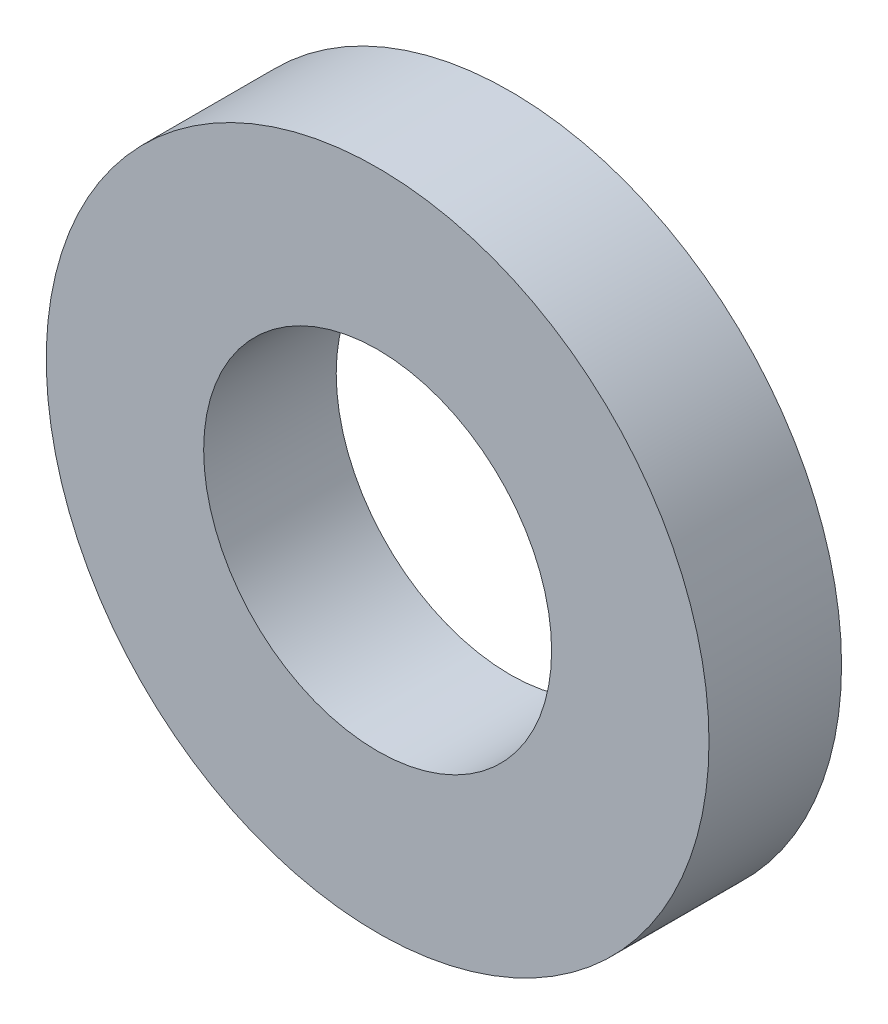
ISO-10303-21;
HEADER;
FILE_DESCRIPTION(('STEP AP214'),'2;1');
FILE_NAME('part.step','',(''),(''),'','','');
FILE_SCHEMA(('AUTOMOTIVE_DESIGN { 1 0 10303 214 1 1 1 1 }'));
ENDSEC;
DATA;
#1=APPLICATION_CONTEXT('core data for automotive mechanical design processes');
#2=APPLICATION_PROTOCOL_DEFINITION('international standard','automotive_design',2000,#1);
#3=PRODUCT_CONTEXT('',#1,'mechanical');
#4=PRODUCT('Part','Part','',(#3));
#5=PRODUCT_RELATED_PRODUCT_CATEGORY('part','',(#4));
#6=PRODUCT_DEFINITION_FORMATION('','',#4);
#7=PRODUCT_DEFINITION_CONTEXT('part definition',#1,'design');
#8=PRODUCT_DEFINITION('design','',#6,#7);
#9=PRODUCT_DEFINITION_SHAPE('','',#8);
#10=(LENGTH_UNIT() NAMED_UNIT(*) SI_UNIT(.MILLI.,.METRE.));
#11=(NAMED_UNIT(*) PLANE_ANGLE_UNIT() SI_UNIT($,.RADIAN.));
#12=(NAMED_UNIT(*) SI_UNIT($,.STERADIAN.) SOLID_ANGLE_UNIT());
#13=UNCERTAINTY_MEASURE_WITH_UNIT(LENGTH_MEASURE(1.E-05),#10,'distance_accuracy_value','');
#14=(GEOMETRIC_REPRESENTATION_CONTEXT(3) GLOBAL_UNCERTAINTY_ASSIGNED_CONTEXT((#13)) GLOBAL_UNIT_ASSIGNED_CONTEXT((#10,
#11,#12)) REPRESENTATION_CONTEXT('',''));
#15=CARTESIAN_POINT('',(0.,0.,0.));
#16=DIRECTION('',(0.,0.,1.));
#17=DIRECTION('',(1.,0.,0.));
#18=AXIS2_PLACEMENT_3D('',#15,#16,#17);
#19=CARTESIAN_POINT('',(350.941170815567,1.11022302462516E-13,16.));
#20=DIRECTION('',(0.,0.,1.));
#21=DIRECTION('',(1.,0.,0.));
#22=AXIS2_PLACEMENT_3D('',#19,#20,#21);
#23=PLANE('',#22);
#24=CARTESIAN_POINT('',(350.941170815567,1.11022302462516E-13,16.));
#25=DIRECTION('',(0.,0.,1.));
#26=DIRECTION('',(1.,0.,0.));
#27=AXIS2_PLACEMENT_3D('',#24,#25,#26);
#28=CIRCLE('',#27,40.);
#29=CARTESIAN_POINT('',(390.941170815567,1.11022302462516E-13,16.));
#30=VERTEX_POINT('',#29);
#31=EDGE_CURVE('E12',#30,#30,#28,.T.);
#32=ORIENTED_EDGE('',*,*,#31,.T.);
#33=EDGE_LOOP('',(#32));
#34=FACE_BOUND('',#33,.T.);
#35=CARTESIAN_POINT('',(350.941170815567,1.11022302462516E-13,16.));
#36=DIRECTION('',(0.,0.,1.));
#37=DIRECTION('',(1.,0.,0.));
#38=AXIS2_PLACEMENT_3D('',#35,#36,#37);
#39=CIRCLE('',#38,21.);
#40=CARTESIAN_POINT('',(371.941170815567,1.11022302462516E-13,16.));
#41=VERTEX_POINT('',#40);
#42=EDGE_CURVE('E51',#41,#41,#39,.T.);
#43=ORIENTED_EDGE('',*,*,#42,.F.);
#44=EDGE_LOOP('',(#43));
#45=FACE_BOUND('',#44,.T.);
#46=ADVANCED_FACE('F40',(#34,#45),#23,.T.);
#47=CARTESIAN_POINT('',(350.941170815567,1.11022302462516E-13,0.));
#48=DIRECTION('',(0.,0.,1.));
#49=DIRECTION('',(1.,0.,0.));
#50=AXIS2_PLACEMENT_3D('',#47,#48,#49);
#51=PLANE('',#50);
#52=CARTESIAN_POINT('',(350.941170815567,1.11022302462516E-13,0.));
#53=DIRECTION('',(0.,0.,1.));
#54=DIRECTION('',(1.,0.,0.));
#55=AXIS2_PLACEMENT_3D('',#52,#53,#54);
#56=CIRCLE('',#55,40.);
#57=CARTESIAN_POINT('',(390.941170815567,1.11022302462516E-13,0.));
#58=VERTEX_POINT('',#57);
#59=EDGE_CURVE('E44',#58,#58,#56,.T.);
#60=ORIENTED_EDGE('',*,*,#59,.F.);
#61=EDGE_LOOP('',(#60));
#62=FACE_BOUND('',#61,.T.);
#63=CARTESIAN_POINT('',(350.941170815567,1.11022302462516E-13,0.));
#64=DIRECTION('',(0.,0.,1.));
#65=DIRECTION('',(1.,0.,0.));
#66=AXIS2_PLACEMENT_3D('',#63,#64,#65);
#67=CIRCLE('',#66,21.);
#68=CARTESIAN_POINT('',(371.941170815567,1.11022302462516E-13,0.));
#69=VERTEX_POINT('',#68);
#70=EDGE_CURVE('E53',#69,#69,#67,.T.);
#71=ORIENTED_EDGE('',*,*,#70,.T.);
#72=EDGE_LOOP('',(#71));
#73=FACE_BOUND('',#72,.T.);
#74=ADVANCED_FACE('F63',(#62,#73),#51,.F.);
#75=CARTESIAN_POINT('',(350.941170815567,1.11022302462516E-13,16.));
#76=DIRECTION('',(0.,0.,-1.));
#77=DIRECTION('',(-1.,0.,0.));
#78=AXIS2_PLACEMENT_3D('',#75,#76,#77);
#79=CYLINDRICAL_SURFACE('',#78,40.);
#80=ORIENTED_EDGE('',*,*,#31,.F.);
#81=EDGE_LOOP('',(#80));
#82=FACE_BOUND('',#81,.T.);
#83=ORIENTED_EDGE('',*,*,#59,.T.);
#84=EDGE_LOOP('',(#83));
#85=FACE_BOUND('',#84,.T.);
#86=ADVANCED_FACE('F42',(#82,#85),#79,.T.);
#87=CARTESIAN_POINT('',(350.941170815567,1.11022302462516E-13,16.));
#88=DIRECTION('',(0.,0.,-1.));
#89=DIRECTION('',(-1.,0.,0.));
#90=AXIS2_PLACEMENT_3D('',#87,#88,#89);
#91=CYLINDRICAL_SURFACE('',#90,21.);
#92=ORIENTED_EDGE('',*,*,#42,.T.);
#93=EDGE_LOOP('',(#92));
#94=FACE_BOUND('',#93,.T.);
#95=ORIENTED_EDGE('',*,*,#70,.F.);
#96=EDGE_LOOP('',(#95));
#97=FACE_BOUND('',#96,.T.);
#98=ADVANCED_FACE('F59',(#94,#97),#91,.F.);
#99=CLOSED_SHELL('',(#46,#74,#86,#98));
#100=MANIFOLD_SOLID_BREP('B2',#99);
#101=ADVANCED_BREP_SHAPE_REPRESENTATION('',(#18,#100),#14);
#102=SHAPE_DEFINITION_REPRESENTATION(#9,#101);
ENDSEC;
END-ISO-10303-21;
